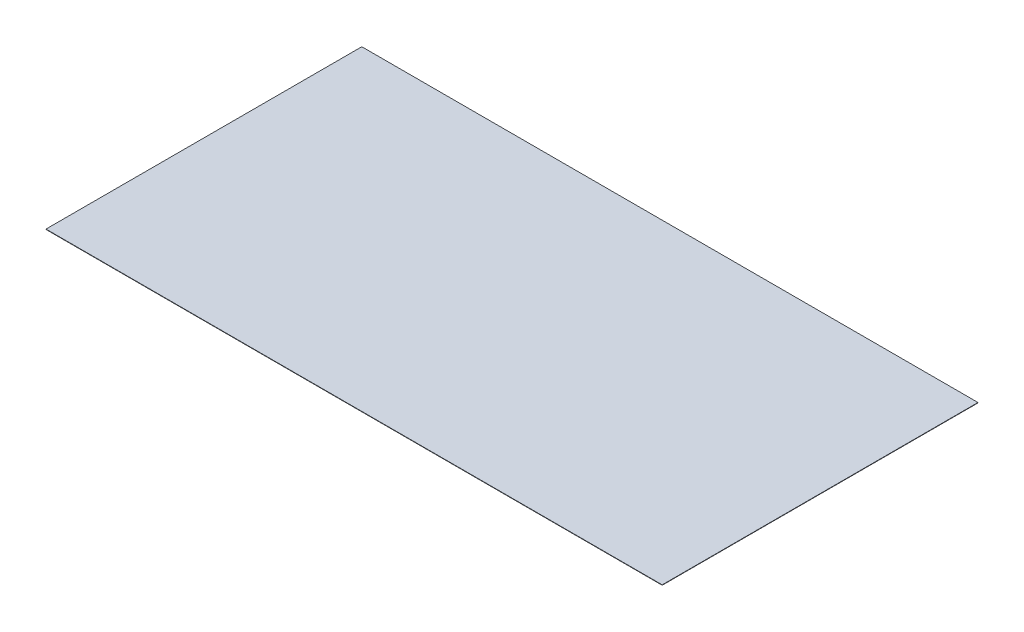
ISO-10303-21;
HEADER;
FILE_DESCRIPTION(('STEP AP214'),'2;1');
FILE_NAME('part.step','',(''),(''),'','','');
FILE_SCHEMA(('AUTOMOTIVE_DESIGN { 1 0 10303 214 1 1 1 1 }'));
ENDSEC;
DATA;
#1=APPLICATION_CONTEXT('core data for automotive mechanical design processes');
#2=APPLICATION_PROTOCOL_DEFINITION('international standard','automotive_design',2000,#1);
#3=PRODUCT_CONTEXT('',#1,'mechanical');
#4=PRODUCT('Part','Part','',(#3));
#5=PRODUCT_RELATED_PRODUCT_CATEGORY('part','',(#4));
#6=PRODUCT_DEFINITION_FORMATION('','',#4);
#7=PRODUCT_DEFINITION_CONTEXT('part definition',#1,'design');
#8=PRODUCT_DEFINITION('design','',#6,#7);
#9=PRODUCT_DEFINITION_SHAPE('','',#8);
#10=(LENGTH_UNIT() NAMED_UNIT(*) SI_UNIT(.MILLI.,.METRE.));
#11=(NAMED_UNIT(*) PLANE_ANGLE_UNIT() SI_UNIT($,.RADIAN.));
#12=(NAMED_UNIT(*) SI_UNIT($,.STERADIAN.) SOLID_ANGLE_UNIT());
#13=UNCERTAINTY_MEASURE_WITH_UNIT(LENGTH_MEASURE(1.E-05),#10,'distance_accuracy_value','');
#14=(GEOMETRIC_REPRESENTATION_CONTEXT(3) GLOBAL_UNCERTAINTY_ASSIGNED_CONTEXT((#13)) GLOBAL_UNIT_ASSIGNED_CONTEXT((#10,
#11,#12)) REPRESENTATION_CONTEXT('',''));
#15=CARTESIAN_POINT('',(0.,0.,0.));
#16=DIRECTION('',(0.,0.,1.));
#17=DIRECTION('',(1.,0.,0.));
#18=AXIS2_PLACEMENT_3D('',#15,#16,#17);
#19=CARTESIAN_POINT('',(0.,0.05,0.));
#20=DIRECTION('',(1.,0.,0.));
#21=DIRECTION('',(0.,0.,-1.));
#22=AXIS2_PLACEMENT_3D('',#19,#20,#21);
#23=PLANE('',#22);
#24=DIRECTION('',(0.,0.,1.));
#25=VECTOR('',#24,1.);
#26=CARTESIAN_POINT('',(0.,0.,0.));
#27=LINE('',#26,#25);
#28=CARTESIAN_POINT('',(0.,0.,-41.));
#29=VERTEX_POINT('',#28);
#30=CARTESIAN_POINT('',(0.,0.,0.));
#31=VERTEX_POINT('',#30);
#32=EDGE_CURVE('E95',#29,#31,#27,.T.);
#33=ORIENTED_EDGE('',*,*,#32,.T.);
#34=DIRECTION('',(0.,-1.,0.));
#35=VECTOR('',#34,1.);
#36=CARTESIAN_POINT('',(0.,0.05,0.));
#37=LINE('',#36,#35);
#38=CARTESIAN_POINT('',(0.,0.05,0.));
#39=VERTEX_POINT('',#38);
#40=EDGE_CURVE('E11',#39,#31,#37,.T.);
#41=ORIENTED_EDGE('',*,*,#40,.F.);
#42=DIRECTION('',(0.,0.,1.));
#43=VECTOR('',#42,1.);
#44=CARTESIAN_POINT('',(0.,0.05,0.));
#45=LINE('',#44,#43);
#46=CARTESIAN_POINT('',(0.,0.05,-41.));
#47=VERTEX_POINT('',#46);
#48=EDGE_CURVE('E83',#47,#39,#45,.T.);
#49=ORIENTED_EDGE('',*,*,#48,.F.);
#50=DIRECTION('',(0.,-1.,0.));
#51=VECTOR('',#50,1.);
#52=CARTESIAN_POINT('',(0.,0.05,-41.));
#53=LINE('',#52,#51);
#54=EDGE_CURVE('E91',#47,#29,#53,.T.);
#55=ORIENTED_EDGE('',*,*,#54,.T.);
#56=EDGE_LOOP('',(#33,#41,#49,#55));
#57=FACE_BOUND('',#56,.T.);
#58=ADVANCED_FACE('F32',(#57),#23,.F.);
#59=CARTESIAN_POINT('',(0.,0.05,0.));
#60=DIRECTION('',(0.,0.,-1.));
#61=DIRECTION('',(-1.,0.,0.));
#62=AXIS2_PLACEMENT_3D('',#59,#60,#61);
#63=PLANE('',#62);
#64=DIRECTION('',(1.,0.,0.));
#65=VECTOR('',#64,1.);
#66=CARTESIAN_POINT('',(0.,0.,0.));
#67=LINE('',#66,#65);
#68=CARTESIAN_POINT('',(80.,0.,0.));
#69=VERTEX_POINT('',#68);
#70=EDGE_CURVE('E87',#31,#69,#67,.T.);
#71=ORIENTED_EDGE('',*,*,#70,.T.);
#72=DIRECTION('',(0.,-1.,0.));
#73=VECTOR('',#72,1.);
#74=CARTESIAN_POINT('',(80.,0.05,0.));
#75=LINE('',#74,#73);
#76=CARTESIAN_POINT('',(80.,0.05,0.));
#77=VERTEX_POINT('',#76);
#78=EDGE_CURVE('E40',#77,#69,#75,.T.);
#79=ORIENTED_EDGE('',*,*,#78,.F.);
#80=DIRECTION('',(1.,0.,0.));
#81=VECTOR('',#80,1.);
#82=CARTESIAN_POINT('',(0.,0.05,0.));
#83=LINE('',#82,#81);
#84=EDGE_CURVE('E78',#39,#77,#83,.T.);
#85=ORIENTED_EDGE('',*,*,#84,.F.);
#86=ORIENTED_EDGE('',*,*,#40,.T.);
#87=EDGE_LOOP('',(#71,#79,#85,#86));
#88=FACE_BOUND('',#87,.T.);
#89=ADVANCED_FACE('F86',(#88),#63,.F.);
#90=CARTESIAN_POINT('',(80.,0.05,0.));
#91=DIRECTION('',(-1.,0.,0.));
#92=DIRECTION('',(0.,0.,1.));
#93=AXIS2_PLACEMENT_3D('',#90,#91,#92);
#94=PLANE('',#93);
#95=DIRECTION('',(0.,0.,-1.));
#96=VECTOR('',#95,1.);
#97=CARTESIAN_POINT('',(80.,0.,0.));
#98=LINE('',#97,#96);
#99=CARTESIAN_POINT('',(80.,0.,-41.));
#100=VERTEX_POINT('',#99);
#101=EDGE_CURVE('E65',#69,#100,#98,.T.);
#102=ORIENTED_EDGE('',*,*,#101,.T.);
#103=DIRECTION('',(0.,-1.,0.));
#104=VECTOR('',#103,1.);
#105=CARTESIAN_POINT('',(80.,0.05,-41.));
#106=LINE('',#105,#104);
#107=CARTESIAN_POINT('',(80.,0.05,-41.));
#108=VERTEX_POINT('',#107);
#109=EDGE_CURVE('E88',#108,#100,#106,.T.);
#110=ORIENTED_EDGE('',*,*,#109,.F.);
#111=DIRECTION('',(0.,0.,-1.));
#112=VECTOR('',#111,1.);
#113=CARTESIAN_POINT('',(80.,0.05,0.));
#114=LINE('',#113,#112);
#115=EDGE_CURVE('E81',#77,#108,#114,.T.);
#116=ORIENTED_EDGE('',*,*,#115,.F.);
#117=ORIENTED_EDGE('',*,*,#78,.T.);
#118=EDGE_LOOP('',(#102,#110,#116,#117));
#119=FACE_BOUND('',#118,.T.);
#120=ADVANCED_FACE('F89',(#119),#94,.F.);
#121=CARTESIAN_POINT('',(0.,0.05,-41.));
#122=DIRECTION('',(0.,0.,1.));
#123=DIRECTION('',(1.,0.,0.));
#124=AXIS2_PLACEMENT_3D('',#121,#122,#123);
#125=PLANE('',#124);
#126=DIRECTION('',(-1.,0.,0.));
#127=VECTOR('',#126,1.);
#128=CARTESIAN_POINT('',(0.,0.,-41.));
#129=LINE('',#128,#127);
#130=EDGE_CURVE('E71',#100,#29,#129,.T.);
#131=ORIENTED_EDGE('',*,*,#130,.T.);
#132=ORIENTED_EDGE('',*,*,#54,.F.);
#133=DIRECTION('',(-1.,0.,0.));
#134=VECTOR('',#133,1.);
#135=CARTESIAN_POINT('',(0.,0.05,-41.));
#136=LINE('',#135,#134);
#137=EDGE_CURVE('E48',#108,#47,#136,.T.);
#138=ORIENTED_EDGE('',*,*,#137,.F.);
#139=ORIENTED_EDGE('',*,*,#109,.T.);
#140=EDGE_LOOP('',(#131,#132,#138,#139));
#141=FACE_BOUND('',#140,.T.);
#142=ADVANCED_FACE('F102',(#141),#125,.F.);
#143=CARTESIAN_POINT('',(0.,0.05,0.));
#144=DIRECTION('',(0.,-1.,0.));
#145=DIRECTION('',(0.,0.,-1.));
#146=AXIS2_PLACEMENT_3D('',#143,#144,#145);
#147=PLANE('',#146);
#148=ORIENTED_EDGE('',*,*,#48,.T.);
#149=ORIENTED_EDGE('',*,*,#84,.T.);
#150=ORIENTED_EDGE('',*,*,#115,.T.);
#151=ORIENTED_EDGE('',*,*,#137,.T.);
#152=EDGE_LOOP('',(#148,#149,#150,#151));
#153=FACE_BOUND('',#152,.T.);
#154=ADVANCED_FACE('F79',(#153),#147,.F.);
#155=CARTESIAN_POINT('',(0.,0.,0.));
#156=DIRECTION('',(0.,-1.,0.));
#157=DIRECTION('',(0.,0.,-1.));
#158=AXIS2_PLACEMENT_3D('',#155,#156,#157);
#159=PLANE('',#158);
#160=ORIENTED_EDGE('',*,*,#32,.F.);
#161=ORIENTED_EDGE('',*,*,#130,.F.);
#162=ORIENTED_EDGE('',*,*,#101,.F.);
#163=ORIENTED_EDGE('',*,*,#70,.F.);
#164=EDGE_LOOP('',(#160,#161,#162,#163));
#165=FACE_BOUND('',#164,.T.);
#166=ADVANCED_FACE('F105',(#165),#159,.T.);
#167=CLOSED_SHELL('',(#58,#89,#120,#142,#154,#166));
#168=MANIFOLD_SOLID_BREP('B2',#167);
#169=ADVANCED_BREP_SHAPE_REPRESENTATION('',(#18,#168),#14);
#170=SHAPE_DEFINITION_REPRESENTATION(#9,#169);
ENDSEC;
END-ISO-10303-21;
